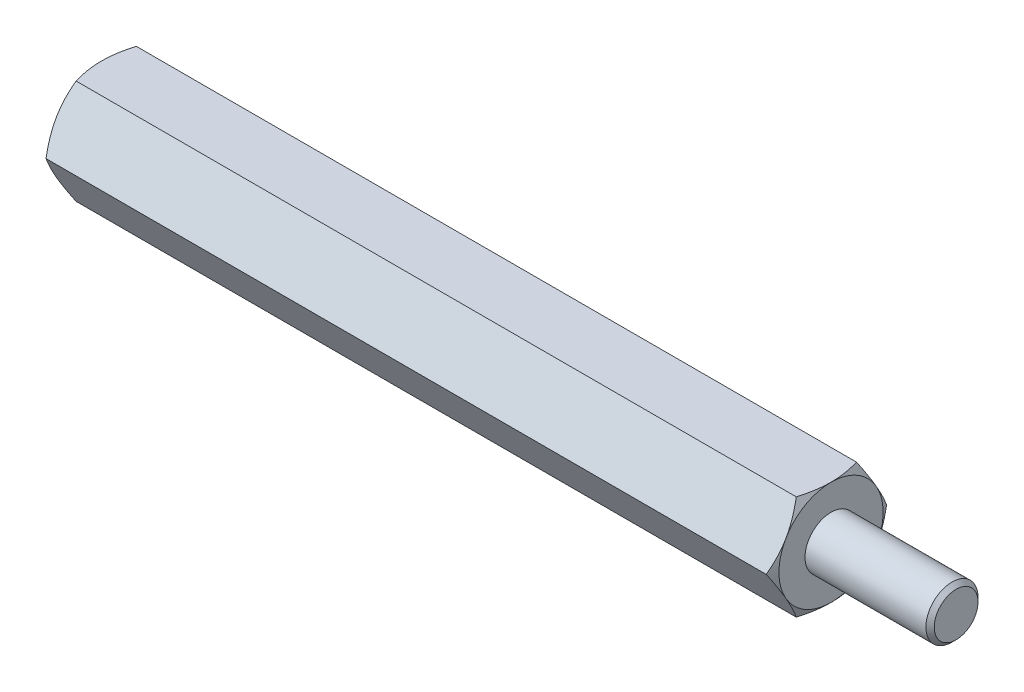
from build123d import *

# Parameters (mm, degrees)
EXTRUDE2_DEPTH = 17.5
SKETCH3_R      = 1.05
EXTRUDE3_DEPTH = 6
SKETCH5_R      = 1.25
EXTRUDE4_DEPTH = 6
CHAMFER1_SIZE  = 0.2


with BuildPart() as part:
    # Sketch1 → Extrude2 (new, symmetric)
    with BuildSketch(Plane(origin=(0, 0, 0), x_dir=(0, 0, -1), z_dir=(1, 0, 0))):
        Polygon((1.443375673, 2.5), (-1.443375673, 2.5), (-2.886751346, 0), (-1.443375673, -2.5), (1.443375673, -2.5), (2.886751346, 0), align=None)
    extrude(amount=EXTRUDE2_DEPTH, both=True)

    # Sketch2 → Cut-Revolve1 (revolve, cut)
    with BuildSketch(Plane.XY):
        with BuildLine():
            Line((-17.5, 2.5), (-16, 5.098076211))
            ThreePointArc((-16, 5.098076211), (-16.48810136, 6.276457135), (-17.5, 5.5))
            Line((-17.5, 5.5), (-17.5, 2.5))
        make_face()
    cut_revolve1 = revolve(axis=Axis((0, 0, 0), (1, 0, 0)), mode=Mode.SUBTRACT)

    # Mirror1: Cut-Revolve1 across plane
    add(cut_revolve1.mirror(Plane(origin=(0, 0, 0), x_dir=(0, 0, 1), z_dir=(1, 0, 0))), mode=Mode.SUBTRACT)

    # Sketch3 → Extrude3 (cut)
    with BuildSketch(Plane.ZY.offset(17.5)):
        Circle(SKETCH3_R)
    extrude(amount=-EXTRUDE3_DEPTH, mode=Mode.SUBTRACT)

    # Sketch4 → Cut-Revolve2 (revolve, cut)
    with BuildSketch(Plane.XY, mode=Mode.PRIVATE) as cut_revolve2_sk:
        Polygon((-11.5, 0), (-11.5, 1.05), (-10.893782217, 0), align=None)
    revolve(cut_revolve2_sk.sketch.rotate(Axis((-10.893782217, 0, 0), (-1, 0, 0)), 270), axis=Axis((-10.893782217, 0, 0), (-1, 0, 0)), mode=Mode.SUBTRACT)

    # Sketch5 → Extrude4 (add)
    with BuildSketch(Plane(origin=(17.5, 0, 0), x_dir=(0, 0, -1), z_dir=(1, 0, 0))):
        Circle(SKETCH5_R)
    extrude(amount=EXTRUDE4_DEPTH)

    # Chamfer1
    chamfer1_edges = [part.edges().sort_by_distance(p)[0] for p in [
        (23.5, 0, 1.25),
    ]]
    chamfer(chamfer1_edges, length=CHAMFER1_SIZE)


solid = part.part
